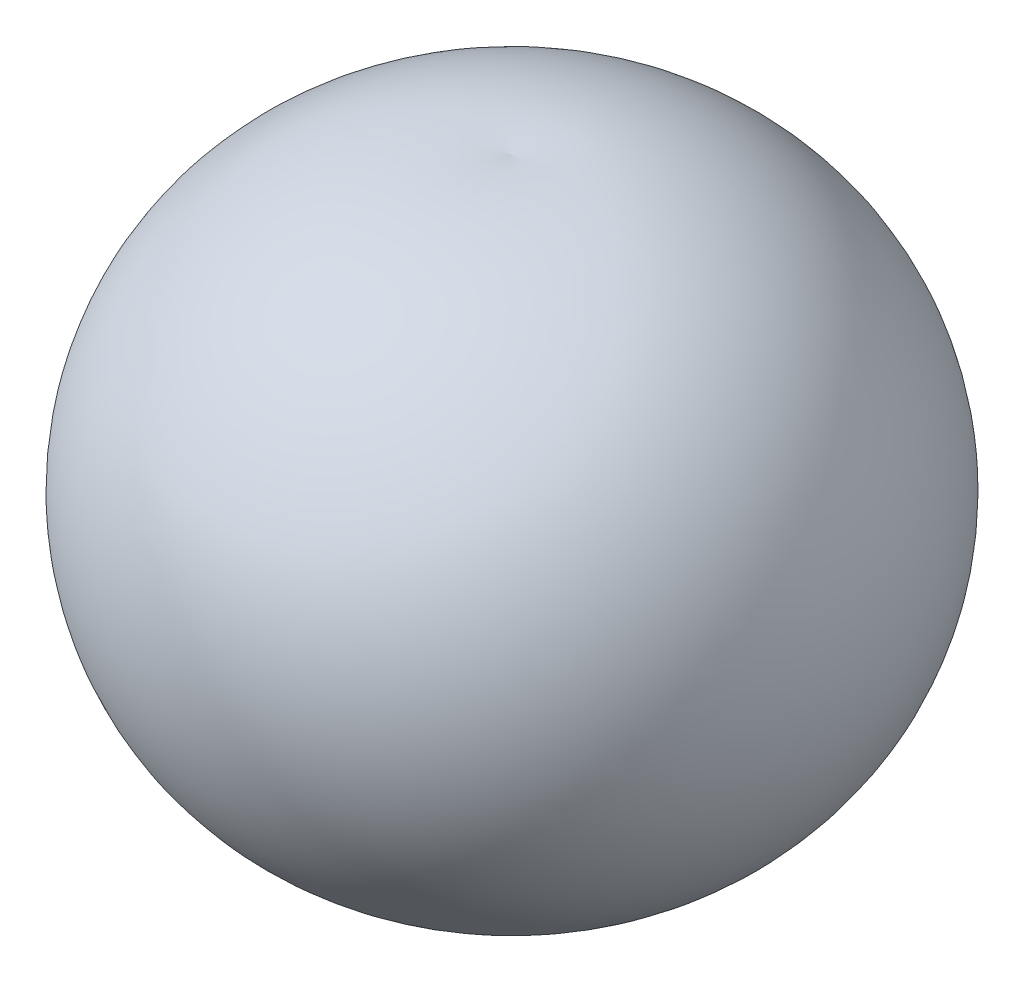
from build123d import *


with BuildPart() as part:
    # Sketch 1 → Revolve 1 (revolve)
    with BuildSketch(Plane.XY):
        with BuildLine():
            Line((0, 2216.458464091), (0, 1304.45023141))
            ThreePointArc((0, 1304.45023141), (272.016653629, 1088.832720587), (459.308473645, 796.590107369))
            ThreePointArc((459.308473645, 796.590107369), (576.892548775, 215.20366988), (0, 77.250084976))
            Line((0, 77.250084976), (0, -1131.060769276))
            ThreePointArc((0, -1131.060769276), (480.565917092, -1270.346588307), (971.246811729, -1172.487507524))
            ThreePointArc((971.246811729, -1172.487507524), (1932.63318743, 936.687762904), (0, 2216.458464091))
        make_face()
    revolve(axis=Axis((0, -1326.458464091, 0), (0, 1, 0)))


solid = part.part
